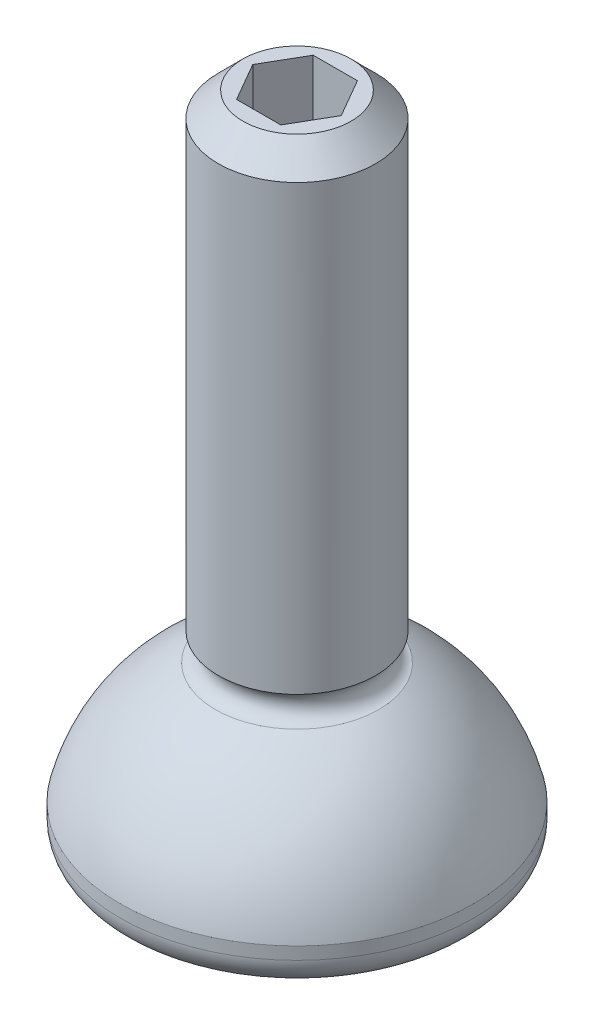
from build123d import *

# Parameters (mm, degrees)
CHAMFER1_SIZE      = 0.635
FILLET1_R          = 0.762
HOLE1_D            = 1.9812
HOLE1_DEPTH        = 3.302
HOLE1_TIP          = 0.595212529
CUT_EXTRUDE1_DEPTH = 2.032
SKETCH5_R          = 0.381


with BuildPart() as part:
    # Sketch1 → Revolve1 (revolve)
    with BuildSketch(Plane.XY):
        with BuildLine():
            Line((0, 0), (4.572, 0))
            Line((4.572, 0), (4.572, 1.085088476))
            ThreePointArc((4.572, 1.085088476), (3.658788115, 2.948537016), (2.032, 4.236930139))
            Line((2.032, 4.236930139), (2.032, 17.018))
            Line((2.032, 17.018), (0, 17.018))
            Line((0, 17.018), (0, 0))
        make_face()
    revolve(axis=Axis((0, -1000, 0), (0, 1, 0)))

    # Chamfer1
    chamfer1_edges = [part.edges().sort_by_distance(p)[0] for p in [
        (-2.032, 17.018, 0),
    ]]
    chamfer(chamfer1_edges, length=CHAMFER1_SIZE)

    # Fillet1
    fillet1_edges = [part.edges().sort_by_distance(p)[0] for p in [
        (-4.572, 0, 0),
    ]]
    fillet(fillet1_edges, radius=FILLET1_R)

    # Hole1
    with Locations(Plane(origin=(0, 17.018, 0), x_dir=(1, 0, 0), z_dir=(0, 1, 0))):
        with Locations((0, 0)):
            Hole(HOLE1_D / 2, depth=HOLE1_DEPTH)
            with Locations((0, 0, -(HOLE1_DEPTH + HOLE1_TIP / 2))):  # 118° drill point
                Cone(0, HOLE1_D / 2, HOLE1_TIP, mode=Mode.SUBTRACT)

    # Sketch4 → Cut-Extrude1 (cut)
    with BuildSketch(Plane(origin=(0, 17.018, 0), x_dir=(1, 0, 0), z_dir=(0, 1, 0))):
        Polygon((0.571923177, 0.9906), (-0.571923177, 0.9906), (-1.143846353, 0), (-0.571923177, -0.9906), (0.571923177, -0.9906), (1.143846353, 0), align=None)
    extrude(amount=-CUT_EXTRUDE1_DEPTH, mode=Mode.SUBTRACT)

    # Sketch5 → Cut-Revolve1 (revolve, cut)
    with BuildSketch(Plane.XY):
        with Locations((2.1844, 4.572)):
            Circle(SKETCH5_R)
    revolve(axis=Axis((0, -1000, 0), (0, 1, 0)), mode=Mode.SUBTRACT)


solid = part.part
